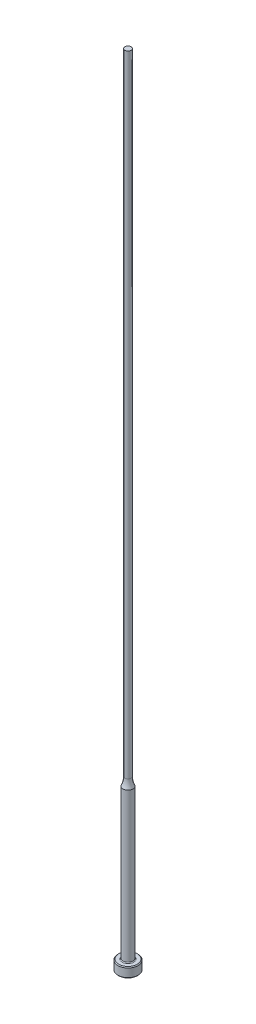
ISO-10303-21;
HEADER;
FILE_DESCRIPTION(('STEP AP214'),'2;1');
FILE_NAME('part.step','',(''),(''),'','','');
FILE_SCHEMA(('AUTOMOTIVE_DESIGN { 1 0 10303 214 1 1 1 1 }'));
ENDSEC;
DATA;
#1=APPLICATION_CONTEXT('core data for automotive mechanical design processes');
#2=APPLICATION_PROTOCOL_DEFINITION('international standard','automotive_design',2000,#1);
#3=PRODUCT_CONTEXT('',#1,'mechanical');
#4=PRODUCT('Part','Part','',(#3));
#5=PRODUCT_RELATED_PRODUCT_CATEGORY('part','',(#4));
#6=PRODUCT_DEFINITION_FORMATION('','',#4);
#7=PRODUCT_DEFINITION_CONTEXT('part definition',#1,'design');
#8=PRODUCT_DEFINITION('design','',#6,#7);
#9=PRODUCT_DEFINITION_SHAPE('','',#8);
#10=(LENGTH_UNIT() NAMED_UNIT(*) SI_UNIT(.MILLI.,.METRE.));
#11=(NAMED_UNIT(*) PLANE_ANGLE_UNIT() SI_UNIT($,.RADIAN.));
#12=(NAMED_UNIT(*) SI_UNIT($,.STERADIAN.) SOLID_ANGLE_UNIT());
#13=UNCERTAINTY_MEASURE_WITH_UNIT(LENGTH_MEASURE(1.E-05),#10,'distance_accuracy_value','');
#14=(GEOMETRIC_REPRESENTATION_CONTEXT(3) GLOBAL_UNCERTAINTY_ASSIGNED_CONTEXT((#13)) GLOBAL_UNIT_ASSIGNED_CONTEXT((#10,
#11,#12)) REPRESENTATION_CONTEXT('',''));
#15=CARTESIAN_POINT('',(0.,0.,0.));
#16=DIRECTION('',(0.,0.,1.));
#17=DIRECTION('',(1.,0.,0.));
#18=AXIS2_PLACEMENT_3D('',#15,#16,#17);
#19=CARTESIAN_POINT('',(-0.991869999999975,254.,0.));
#20=DIRECTION('',(0.,1.,0.));
#21=DIRECTION('',(0.,0.,1.));
#22=AXIS2_PLACEMENT_3D('',#19,#20,#21);
#23=PLANE('',#22);
#24=CARTESIAN_POINT('',(0.,254.,0.));
#25=DIRECTION('',(0.,1.,0.));
#26=DIRECTION('',(0.,0.,1.));
#27=AXIS2_PLACEMENT_3D('',#24,#25,#26);
#28=CIRCLE('',#27,0.991869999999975);
#29=CARTESIAN_POINT('',(0.,254.,0.991869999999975));
#30=VERTEX_POINT('',#29);
#31=EDGE_CURVE('E61',#30,#30,#28,.T.);
#32=ORIENTED_EDGE('',*,*,#31,.T.);
#33=EDGE_LOOP('',(#32));
#34=FACE_BOUND('',#33,.T.);
#35=ADVANCED_FACE('F35',(#34),#23,.T.);
#36=CARTESIAN_POINT('',(0.,259.958771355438,0.));
#37=DIRECTION('',(0.,1.,0.));
#38=DIRECTION('',(0.,0.,1.));
#39=AXIS2_PLACEMENT_3D('',#36,#37,#38);
#40=CYLINDRICAL_SURFACE('',#39,0.991869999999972);
#41=CARTESIAN_POINT('',(0.,53.4850932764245,0.));
#42=DIRECTION('',(0.,1.,0.));
#43=DIRECTION('',(0.,0.,1.));
#44=AXIS2_PLACEMENT_3D('',#41,#42,#43);
#45=CIRCLE('',#44,0.991869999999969);
#46=CARTESIAN_POINT('',(0.,53.4850932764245,0.991869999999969));
#47=VERTEX_POINT('',#46);
#48=EDGE_CURVE('E64',#47,#47,#45,.T.);
#49=ORIENTED_EDGE('',*,*,#48,.T.);
#50=EDGE_LOOP('',(#49));
#51=FACE_BOUND('',#50,.T.);
#52=ORIENTED_EDGE('',*,*,#31,.F.);
#53=EDGE_LOOP('',(#52));
#54=FACE_BOUND('',#53,.T.);
#55=ADVANCED_FACE('F84',(#51,#54),#40,.T.);
#56=CARTESIAN_POINT('',(0.,53.4850932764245,0.));
#57=DIRECTION('',(0.,1.,0.));
#58=DIRECTION('',(0.,0.,1.));
#59=AXIS2_PLACEMENT_3D('',#56,#57,#58);
#60=TOROIDAL_SURFACE('',#59,7.34186999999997,6.35);
#61=CARTESIAN_POINT('',(0.,50.8,0.));
#62=DIRECTION('',(0.,1.,0.));
#63=DIRECTION('',(0.,0.,1.));
#64=AXIS2_PLACEMENT_3D('',#61,#62,#63);
#65=CIRCLE('',#64,1.58749999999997);
#66=CARTESIAN_POINT('',(0.,50.8,1.58749999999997));
#67=VERTEX_POINT('',#66);
#68=EDGE_CURVE('E67',#67,#67,#65,.T.);
#69=ORIENTED_EDGE('',*,*,#68,.T.);
#70=EDGE_LOOP('',(#69));
#71=FACE_BOUND('',#70,.T.);
#72=ORIENTED_EDGE('',*,*,#48,.F.);
#73=EDGE_LOOP('',(#72));
#74=FACE_BOUND('',#73,.T.);
#75=ADVANCED_FACE('F71',(#71,#74),#60,.F.);
#76=CARTESIAN_POINT('',(0.,259.958771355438,0.));
#77=DIRECTION('',(0.,1.,0.));
#78=DIRECTION('',(0.,0.,1.));
#79=AXIS2_PLACEMENT_3D('',#76,#77,#78);
#80=CYLINDRICAL_SURFACE('',#79,1.58749999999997);
#81=CARTESIAN_POINT('',(0.,3.42900000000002,0.));
#82=DIRECTION('',(0.,1.,0.));
#83=DIRECTION('',(0.,0.,1.));
#84=AXIS2_PLACEMENT_3D('',#81,#82,#83);
#85=CIRCLE('',#84,1.58749999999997);
#86=CARTESIAN_POINT('',(0.,3.42900000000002,1.58749999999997));
#87=VERTEX_POINT('',#86);
#88=EDGE_CURVE('E42',#87,#87,#85,.T.);
#89=ORIENTED_EDGE('',*,*,#88,.T.);
#90=EDGE_LOOP('',(#89));
#91=FACE_BOUND('',#90,.T.);
#92=ORIENTED_EDGE('',*,*,#68,.F.);
#93=EDGE_LOOP('',(#92));
#94=FACE_BOUND('',#93,.T.);
#95=ADVANCED_FACE('F74',(#91,#94),#80,.T.);
#96=CARTESIAN_POINT('',(-3.17499999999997,3.175,0.));
#97=DIRECTION('',(0.,1.,0.));
#98=DIRECTION('',(0.,0.,1.));
#99=AXIS2_PLACEMENT_3D('',#96,#97,#98);
#100=PLANE('',#99);
#101=CARTESIAN_POINT('',(0.,3.175,0.));
#102=DIRECTION('',(0.,1.,0.));
#103=DIRECTION('',(0.,0.,1.));
#104=AXIS2_PLACEMENT_3D('',#101,#102,#103);
#105=CIRCLE('',#104,1.84149999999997);
#106=CARTESIAN_POINT('',(0.,3.175,1.84149999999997));
#107=VERTEX_POINT('',#106);
#108=EDGE_CURVE('E10',#107,#107,#105,.F.);
#109=ORIENTED_EDGE('',*,*,#108,.T.);
#110=EDGE_LOOP('',(#109));
#111=FACE_BOUND('',#110,.T.);
#112=CARTESIAN_POINT('',(0.,3.175,0.));
#113=DIRECTION('',(0.,1.,0.));
#114=DIRECTION('',(0.,0.,1.));
#115=AXIS2_PLACEMENT_3D('',#112,#113,#114);
#116=CIRCLE('',#115,2.92099999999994);
#117=CARTESIAN_POINT('',(0.,3.175,2.92099999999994));
#118=VERTEX_POINT('',#117);
#119=EDGE_CURVE('E58',#118,#118,#116,.T.);
#120=ORIENTED_EDGE('',*,*,#119,.T.);
#121=EDGE_LOOP('',(#120));
#122=FACE_BOUND('',#121,.T.);
#123=ADVANCED_FACE('F76',(#111,#122),#100,.T.);
#124=CARTESIAN_POINT('',(0.,259.958771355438,0.));
#125=DIRECTION('',(0.,1.,0.));
#126=DIRECTION('',(0.,0.,1.));
#127=AXIS2_PLACEMENT_3D('',#124,#125,#126);
#128=CYLINDRICAL_SURFACE('',#127,3.17499999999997);
#129=CARTESIAN_POINT('',(0.,2.92100000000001,0.));
#130=DIRECTION('',(0.,1.,0.));
#131=DIRECTION('',(0.,0.,1.));
#132=AXIS2_PLACEMENT_3D('',#129,#130,#131);
#133=CIRCLE('',#132,3.17499999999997);
#134=CARTESIAN_POINT('',(0.,2.92100000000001,3.17499999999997));
#135=VERTEX_POINT('',#134);
#136=EDGE_CURVE('E50',#135,#135,#133,.F.);
#137=ORIENTED_EDGE('',*,*,#136,.T.);
#138=EDGE_LOOP('',(#137));
#139=FACE_BOUND('',#138,.T.);
#140=CARTESIAN_POINT('',(0.,0.253999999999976,0.));
#141=DIRECTION('',(0.,-1.,0.));
#142=DIRECTION('',(0.,0.,-1.));
#143=AXIS2_PLACEMENT_3D('',#140,#141,#142);
#144=CIRCLE('',#143,3.17499999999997);
#145=CARTESIAN_POINT('',(0.,0.253999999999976,-3.17499999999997));
#146=VERTEX_POINT('',#145);
#147=EDGE_CURVE('E55',#146,#146,#144,.F.);
#148=ORIENTED_EDGE('',*,*,#147,.T.);
#149=EDGE_LOOP('',(#148));
#150=FACE_BOUND('',#149,.T.);
#151=ADVANCED_FACE('F82',(#139,#150),#128,.T.);
#152=CARTESIAN_POINT('',(0.,0.,0.));
#153=DIRECTION('',(0.,-1.,0.));
#154=DIRECTION('',(0.,0.,-1.));
#155=AXIS2_PLACEMENT_3D('',#152,#153,#154);
#156=PLANE('',#155);
#157=CARTESIAN_POINT('',(0.,0.,0.));
#158=DIRECTION('',(0.,-1.,0.));
#159=DIRECTION('',(0.,0.,-1.));
#160=AXIS2_PLACEMENT_3D('',#157,#158,#159);
#161=CIRCLE('',#160,2.92100000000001);
#162=CARTESIAN_POINT('',(0.,0.,-2.92100000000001));
#163=VERTEX_POINT('',#162);
#164=EDGE_CURVE('E46',#163,#163,#161,.T.);
#165=ORIENTED_EDGE('',*,*,#164,.T.);
#166=EDGE_LOOP('',(#165));
#167=FACE_BOUND('',#166,.T.);
#168=ADVANCED_FACE('F98',(#167),#156,.T.);
#169=CARTESIAN_POINT('',(0.,3.17499999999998,0.));
#170=DIRECTION('',(0.,-1.,0.));
#171=DIRECTION('',(0.,0.,-1.));
#172=AXIS2_PLACEMENT_3D('',#169,#170,#171);
#173=CONICAL_SURFACE('',#172,2.92099999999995,0.785398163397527);
#174=ORIENTED_EDGE('',*,*,#136,.F.);
#175=EDGE_LOOP('',(#174));
#176=FACE_BOUND('',#175,.T.);
#177=ORIENTED_EDGE('',*,*,#119,.F.);
#178=EDGE_LOOP('',(#177));
#179=FACE_BOUND('',#178,.T.);
#180=ADVANCED_FACE('F95',(#176,#179),#173,.T.);
#181=CARTESIAN_POINT('',(0.,0.253999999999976,0.));
#182=DIRECTION('',(0.,1.,0.));
#183=DIRECTION('',(0.,0.,1.));
#184=AXIS2_PLACEMENT_3D('',#181,#182,#183);
#185=CONICAL_SURFACE('',#184,3.17499999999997,0.785398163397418);
#186=ORIENTED_EDGE('',*,*,#164,.F.);
#187=EDGE_LOOP('',(#186));
#188=FACE_BOUND('',#187,.T.);
#189=ORIENTED_EDGE('',*,*,#147,.F.);
#190=EDGE_LOOP('',(#189));
#191=FACE_BOUND('',#190,.T.);
#192=ADVANCED_FACE('F97',(#188,#191),#185,.T.);
#193=CARTESIAN_POINT('',(0.,3.42900000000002,0.));
#194=DIRECTION('',(0.,1.,0.));
#195=DIRECTION('',(0.,0.,1.));
#196=AXIS2_PLACEMENT_3D('',#193,#194,#195);
#197=TOROIDAL_SURFACE('',#196,1.84149999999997,0.254);
#198=ORIENTED_EDGE('',*,*,#108,.F.);
#199=EDGE_LOOP('',(#198));
#200=FACE_BOUND('',#199,.T.);
#201=ORIENTED_EDGE('',*,*,#88,.F.);
#202=EDGE_LOOP('',(#201));
#203=FACE_BOUND('',#202,.T.);
#204=ADVANCED_FACE('F37',(#200,#203),#197,.F.);
#205=CLOSED_SHELL('',(#35,#55,#75,#95,#123,#151,#168,#180,#192,#204));
#206=MANIFOLD_SOLID_BREP('B2',#205);
#207=ADVANCED_BREP_SHAPE_REPRESENTATION('',(#18,#206),#14);
#208=SHAPE_DEFINITION_REPRESENTATION(#9,#207);
ENDSEC;
END-ISO-10303-21;
